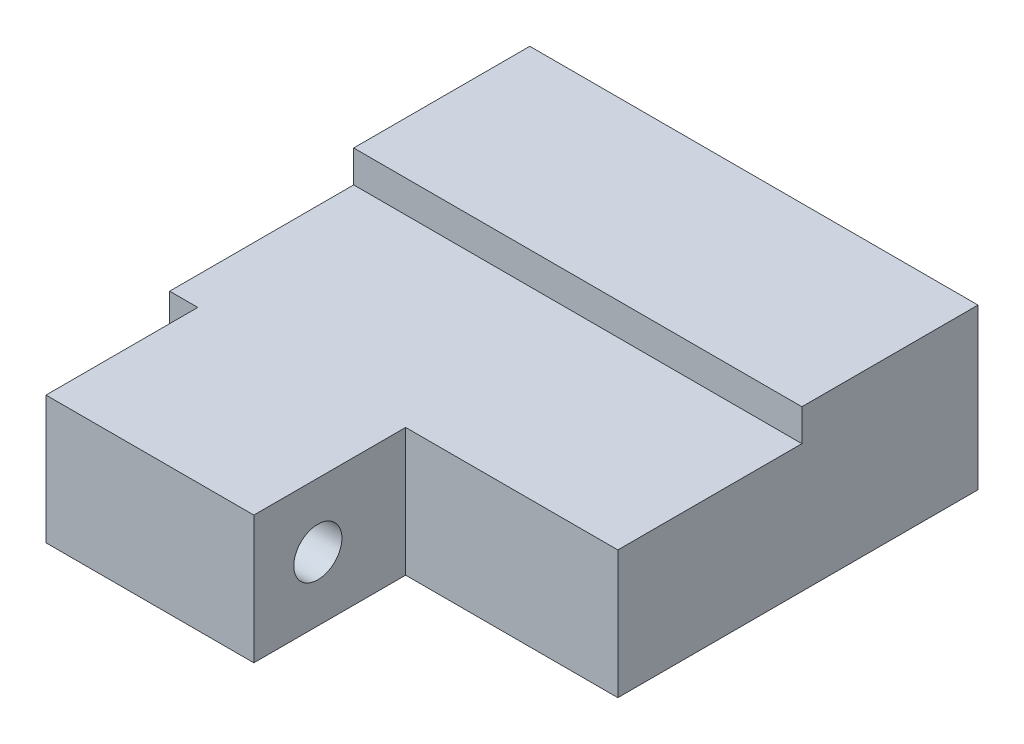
from build123d import *

# Parameters (mm, degrees)
SKETCH2_W           = 44.4754
SKETCH2_H           = 15.875
BOSS_EXTRUDE1_DEPTH = 50.8
SKETCH3_W           = 21.0566
SKETCH3_H           = 15.0622
SKETCH3_W_2         = 2.794
CUT_EXTRUDE1_DEPTH  = 12.7
SKETCH4_R           = 2.3876
CUT_EXTRUDE2_DEPTH  = 25.4
SKETCH5_R           = 2.3876
CUT_EXTRUDE3_DEPTH  = 15.875
SKETCH6_W           = 33.3248
SKETCH6_H           = 3.175
CUT_EXTRUDE5_DEPTH  = 38.1


with BuildPart() as part:
    # Sketch2 → Boss-Extrude1 (new body)
    with BuildSketch(Plane.XY):
        with Locations((0, -3.1623)):
            Rectangle(SKETCH2_W, SKETCH2_H)
    extrude(amount=BOSS_EXTRUDE1_DEPTH)

    # Sketch3 → Cut-Extrude1 (cut, symmetric)
    with BuildSketch(Plane(origin=(0, 0, 0), x_dir=(1, 0, 0), z_dir=(0, 1, 0))):
        with Locations((11.7094, -43.2689)):
            Rectangle(SKETCH3_W, SKETCH3_H)
        with Locations((-20.8407, -43.2689)):
            Rectangle(SKETCH3_W_2, SKETCH3_H)
    extrude(amount=CUT_EXTRUDE1_DEPTH, both=True, mode=Mode.SUBTRACT)

    # Sketch4 → Cut-Extrude2 (cut, symmetric)
    with BuildSketch(Plane(origin=(0, 0, 0), x_dir=(0, 0, -1), z_dir=(1, 0, 0))):
        with Locations((-44.45, -4.7498)):
            Circle(SKETCH4_R)
    extrude(amount=CUT_EXTRUDE2_DEPTH, both=True, mode=Mode.SUBTRACT)

    # Sketch5 → Cut-Extrude3 (cut)
    with BuildSketch(Plane(origin=(0, 0, 0), x_dir=(-1, 0, 0), z_dir=(0, 0, -1))):
        with Locations((-17.4625, 0)):
            Circle(SKETCH5_R)
        with Locations((17.4625, 0)):
            Circle(SKETCH5_R)
    extrude(amount=-CUT_EXTRUDE3_DEPTH, mode=Mode.SUBTRACT)

    # Sketch6 → Cut-Extrude5 (cut, symmetric)
    with BuildSketch(Plane(origin=(0, 0, 0), x_dir=(0, 0, -1), z_dir=(1, 0, 0))):
        with Locations((-34.1376, 3.1877)):
            Rectangle(SKETCH6_W, SKETCH6_H)
    extrude(amount=CUT_EXTRUDE5_DEPTH, both=True, mode=Mode.SUBTRACT)


solid = part.part
